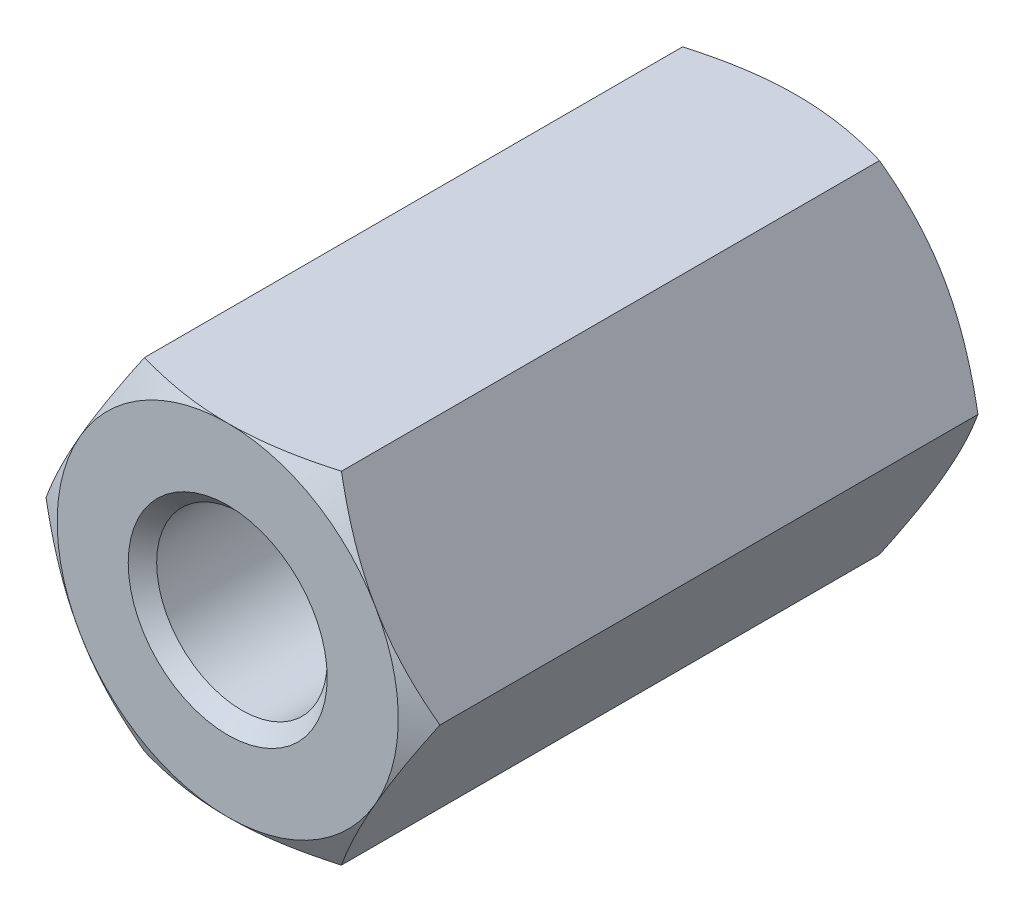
from build123d import *

# Parameters (mm, degrees)
BOSS_EXTRUDE1_DEPTH      = 5
SKETCH2_OUTSIDE_W        = 37.974
SKETCH2_OUTSIDE_H        = 37.046
SKETCH2_OUTSIDE_R        = 3
CUT_EXTRUDE1_DEPTH       = 7.782329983
CUT_EXTRUDE1_DRAFT       = -60
SKETCH3_R                = 1.5
SKETCH3_R_2              = 1.25
CUT_EXTRUDE2_DEPTH       = 5
SKETCH3_2_R              = 1.25
CUT_EXTRUDE3_DEPTH       = 5.75
CHAMFER1_SIZE            = 0.25
MIRROR1_COPY_1_SKETCH_W  = 37.974
MIRROR1_COPY_1_SKETCH_H  = 37.046
MIRROR1_COPY_1_SKETCH_R  = 3
MIRROR1_COPY_1_DEPTH     = 7.782329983
MIRROR1_COPY_1_DRAFT     = -60
CHAMFER1_OF_MIRROR1_SIZE = 0.25


with BuildPart() as part:
    # Sketch1 → Boss-Extrude1 (new body)
    with BuildSketch(Plane.XY):
        Polygon((1.732050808, 3), (-1.732050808, 3), (-3.464101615, 0), (-1.732050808, -3), (1.732050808, -3), (3.464101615, 0), align=None)
    boss_extrude1 = extrude(amount=-BOSS_EXTRUDE1_DEPTH)


with BuildPart() as cut_extrude1_tool:
    # Sketch2 outside → Cut-Extrude1 (with draft: the straight prism first)
    with BuildSketch(Plane(origin=(0, 0, -5), x_dir=(-1, 0, 0), z_dir=(0, 0, -1))):
        Rectangle(SKETCH2_OUTSIDE_W, SKETCH2_OUTSIDE_H)
        Circle(SKETCH2_OUTSIDE_R, mode=Mode.SUBTRACT)
    extrude(amount=-CUT_EXTRUDE1_DEPTH)
    # Cut-Extrude1: the draft: its side faces are tilted about the plane it starts from
    cut_extrude1_sides = [cut_extrude1_tool.faces().sort_by_distance(p)[0] for p in [
        (0, -18.523, -1.108835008),
        (-18.987, 0, -1.108835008),
        (0, 18.523, -1.108835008),
        (18.987, 0, -1.108835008),
        (3, 0, -1.108835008),
    ]]
    draft(cut_extrude1_sides, Plane(origin=(0, 0, -5), x_dir=(-1, 0, 0), z_dir=(0, 0, -1)), CUT_EXTRUDE1_DRAFT)


with BuildPart() as part_1:
    add(part.part)

    # Cut-Extrude1: cut by cut_extrude1_tool
    add(cut_extrude1_tool.part, mode=Mode.SUBTRACT)

    # Sketch3 → Cut-Extrude2 (cut)
    with BuildSketch(Plane(origin=(0, 0, -5), x_dir=(-1, 0, 0), z_dir=(0, 0, -1))):
        Circle(SKETCH3_R)
        Circle(SKETCH3_R_2, mode=Mode.SUBTRACT)
    cut_extrude2 = extrude(amount=-CUT_EXTRUDE2_DEPTH, mode=Mode.SUBTRACT)


with BuildPart() as cut_extrude2_piece_1:
    # of the separate pieces the step leaves, piece 1, a body of its own (cut_extrude2_pieces)
    add(part_1.part.solids().sort_by_distance((1.732050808, 3, 0))[0])

    # Chamfer1
    chamfer1_edges = [cut_extrude2_piece_1.edges().sort_by_distance(p)[0] for p in [
        (1.5, 0, -5),
    ]]
    chamfer(chamfer1_edges, length=CHAMFER1_SIZE)


with BuildPart() as cut_extrude2_piece_2:
    # of the separate pieces the step leaves, piece 2, a body of its own (cut_extrude2_pieces)
    add(part_1.part.solids().sort_by_distance((-1.25, 0, 0))[0])

    # Sketch3_2 → Cut-Extrude3 (cut)
    with BuildSketch(Plane(origin=(0, 0, -5), x_dir=(-1, 0, 0), z_dir=(0, 0, -1))):
        Circle(SKETCH3_2_R)
    cut_extrude3 = extrude(amount=-CUT_EXTRUDE3_DEPTH, mode=Mode.SUBTRACT)


with BuildPart() as cut_extrude2_piece_1_1:
    add(cut_extrude2_piece_1.part)

    # Mirror1: Boss-Extrude1, Cut-Extrude2, Cut-Extrude3 across plane
    add(boss_extrude1.mirror(Plane.XY))
    add(cut_extrude2.mirror(Plane.XY), mode=Mode.SUBTRACT)
    add(cut_extrude3.mirror(Plane.XY), mode=Mode.SUBTRACT)


with BuildPart() as mirror1_copy_1_tool:
    # Mirror1 copy 1 sketch → Mirror1 copy 1 (with draft: the straight prism first)
    with BuildSketch(Plane(origin=(0, 0, 5), x_dir=(-1, 0, 0), z_dir=(0, 0, 1))):
        Rectangle(MIRROR1_COPY_1_SKETCH_W, MIRROR1_COPY_1_SKETCH_H)
        Circle(MIRROR1_COPY_1_SKETCH_R, mode=Mode.SUBTRACT)
    extrude(amount=-MIRROR1_COPY_1_DEPTH)
    # Mirror1 copy 1: the draft: its side faces are tilted about the plane it starts from
    mirror1_copy_1_sides = [mirror1_copy_1_tool.faces().sort_by_distance(p)[0] for p in [
        (0, -18.523, 1.108835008),
        (-18.987, 0, 1.108835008),
        (0, 18.523, 1.108835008),
        (18.987, 0, 1.108835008),
        (3, 0, 1.108835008),
    ]]
    draft(mirror1_copy_1_sides, Plane(origin=(0, 0, 5), x_dir=(-1, 0, 0), z_dir=(0, 0, 1)), MIRROR1_COPY_1_DRAFT)


with BuildPart() as cut_extrude2_piece_1_2:
    add(cut_extrude2_piece_1_1.part)

    # Mirror1 copy 1: cut by mirror1_copy_1_tool
    add(mirror1_copy_1_tool.part, mode=Mode.SUBTRACT)

    # Chamfer1 of Mirror1
    chamfer1_of_mirror1_edges = [cut_extrude2_piece_1_2.edges().sort_by_distance(p)[0] for p in [
        (1.5, 0, 5),
    ]]
    chamfer(chamfer1_of_mirror1_edges, length=CHAMFER1_OF_MIRROR1_SIZE)


solid = cut_extrude2_piece_1_2.part
